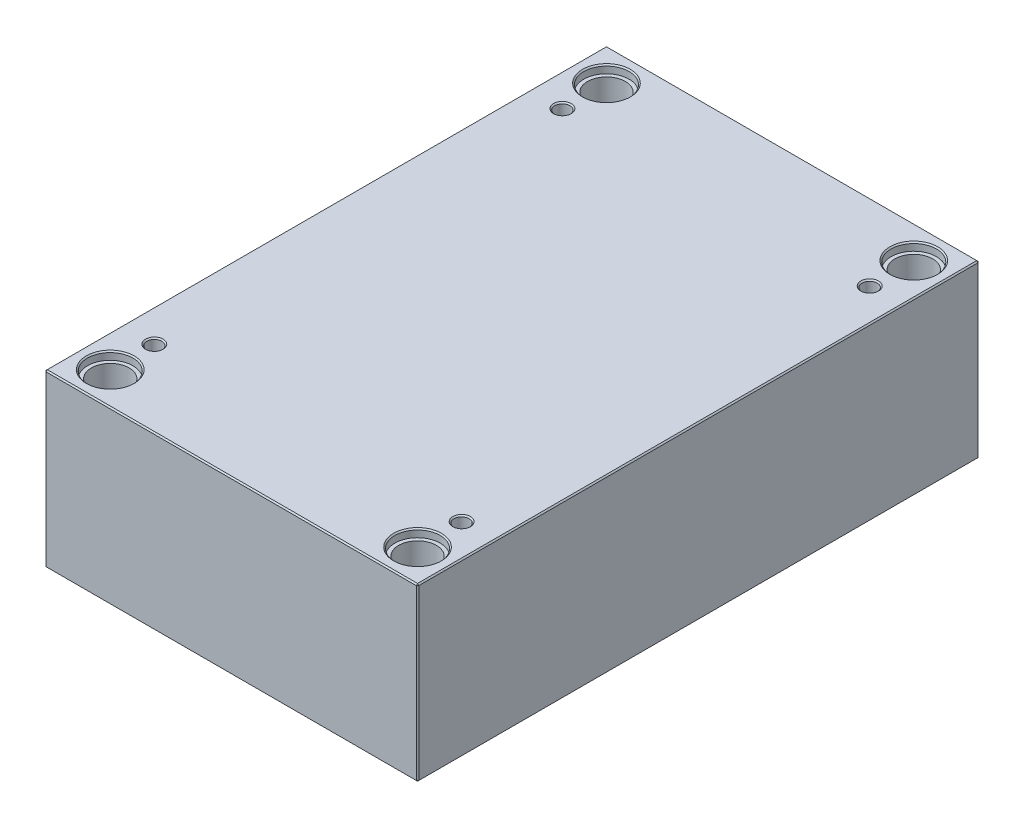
ISO-10303-21;
HEADER;
FILE_DESCRIPTION(('STEP AP214'),'2;1');
FILE_NAME('part.step','',(''),(''),'','','');
FILE_SCHEMA(('AUTOMOTIVE_DESIGN { 1 0 10303 214 1 1 1 1 }'));
ENDSEC;
DATA;
#1=APPLICATION_CONTEXT('core data for automotive mechanical design processes');
#2=APPLICATION_PROTOCOL_DEFINITION('international standard','automotive_design',2000,#1);
#3=PRODUCT_CONTEXT('',#1,'mechanical');
#4=PRODUCT('Part','Part','',(#3));
#5=PRODUCT_RELATED_PRODUCT_CATEGORY('part','',(#4));
#6=PRODUCT_DEFINITION_FORMATION('','',#4);
#7=PRODUCT_DEFINITION_CONTEXT('part definition',#1,'design');
#8=PRODUCT_DEFINITION('design','',#6,#7);
#9=PRODUCT_DEFINITION_SHAPE('','',#8);
#10=(LENGTH_UNIT() NAMED_UNIT(*) SI_UNIT(.MILLI.,.METRE.));
#11=(NAMED_UNIT(*) PLANE_ANGLE_UNIT() SI_UNIT($,.RADIAN.));
#12=(NAMED_UNIT(*) SI_UNIT($,.STERADIAN.) SOLID_ANGLE_UNIT());
#13=UNCERTAINTY_MEASURE_WITH_UNIT(LENGTH_MEASURE(1.E-05),#10,'distance_accuracy_value','');
#14=(GEOMETRIC_REPRESENTATION_CONTEXT(3) GLOBAL_UNCERTAINTY_ASSIGNED_CONTEXT((#13)) GLOBAL_UNIT_ASSIGNED_CONTEXT((#10,
#11,#12)) REPRESENTATION_CONTEXT('',''));
#15=CARTESIAN_POINT('',(0.,0.,0.));
#16=DIRECTION('',(0.,0.,1.));
#17=DIRECTION('',(1.,0.,0.));
#18=AXIS2_PLACEMENT_3D('',#15,#16,#17);
#19=CARTESIAN_POINT('',(-122.,0.,-197.));
#20=DIRECTION('',(0.,1.,0.));
#21=DIRECTION('',(0.,0.,1.));
#22=AXIS2_PLACEMENT_3D('',#19,#20,#21);
#23=CYLINDRICAL_SURFACE('',#22,15.);
#24=CARTESIAN_POINT('',(-122.,1.00000000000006,-197.));
#25=DIRECTION('',(0.,1.,0.));
#26=DIRECTION('',(0.,0.,1.));
#27=AXIS2_PLACEMENT_3D('',#24,#25,#26);
#28=CIRCLE('',#27,15.);
#29=CARTESIAN_POINT('',(-122.,1.00000000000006,-182.));
#30=VERTEX_POINT('',#29);
#31=EDGE_CURVE('E472',#30,#30,#28,.F.);
#32=ORIENTED_EDGE('',*,*,#31,.T.);
#33=EDGE_LOOP('',(#32));
#34=FACE_BOUND('',#33,.T.);
#35=CARTESIAN_POINT('',(-122.,129.7,-197.));
#36=DIRECTION('',(0.,1.,0.));
#37=DIRECTION('',(0.,0.,1.));
#38=AXIS2_PLACEMENT_3D('',#35,#36,#37);
#39=CIRCLE('',#38,15.);
#40=CARTESIAN_POINT('',(-122.,129.7,-182.));
#41=VERTEX_POINT('',#40);
#42=EDGE_CURVE('E221',#41,#41,#39,.F.);
#43=ORIENTED_EDGE('',*,*,#42,.F.);
#44=EDGE_LOOP('',(#43));
#45=FACE_BOUND('',#44,.T.);
#46=ADVANCED_FACE('F16',(#34,#45),#23,.F.);
#47=CARTESIAN_POINT('',(122.,0.,-197.));
#48=DIRECTION('',(0.,1.,0.));
#49=DIRECTION('',(0.,0.,1.));
#50=AXIS2_PLACEMENT_3D('',#47,#48,#49);
#51=CYLINDRICAL_SURFACE('',#50,15.);
#52=CARTESIAN_POINT('',(122.,1.00000000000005,-197.));
#53=DIRECTION('',(0.,1.,0.));
#54=DIRECTION('',(0.,0.,1.));
#55=AXIS2_PLACEMENT_3D('',#52,#53,#54);
#56=CIRCLE('',#55,15.);
#57=CARTESIAN_POINT('',(122.,1.00000000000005,-182.));
#58=VERTEX_POINT('',#57);
#59=EDGE_CURVE('E474',#58,#58,#56,.F.);
#60=ORIENTED_EDGE('',*,*,#59,.T.);
#61=EDGE_LOOP('',(#60));
#62=FACE_BOUND('',#61,.T.);
#63=CARTESIAN_POINT('',(122.,129.7,-197.));
#64=DIRECTION('',(0.,1.,0.));
#65=DIRECTION('',(0.,0.,1.));
#66=AXIS2_PLACEMENT_3D('',#63,#64,#65);
#67=CIRCLE('',#66,15.);
#68=CARTESIAN_POINT('',(122.,129.7,-182.));
#69=VERTEX_POINT('',#68);
#70=EDGE_CURVE('E218',#69,#69,#67,.F.);
#71=ORIENTED_EDGE('',*,*,#70,.F.);
#72=EDGE_LOOP('',(#71));
#73=FACE_BOUND('',#72,.T.);
#74=ADVANCED_FACE('F263',(#62,#73),#51,.F.);
#75=CARTESIAN_POINT('',(122.,0.,197.));
#76=DIRECTION('',(0.,1.,0.));
#77=DIRECTION('',(0.,0.,1.));
#78=AXIS2_PLACEMENT_3D('',#75,#76,#77);
#79=CYLINDRICAL_SURFACE('',#78,15.);
#80=CARTESIAN_POINT('',(122.,1.00000000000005,197.));
#81=DIRECTION('',(0.,1.,0.));
#82=DIRECTION('',(0.,0.,1.));
#83=AXIS2_PLACEMENT_3D('',#80,#81,#82);
#84=CIRCLE('',#83,15.);
#85=CARTESIAN_POINT('',(122.,1.00000000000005,212.));
#86=VERTEX_POINT('',#85);
#87=EDGE_CURVE('E477',#86,#86,#84,.F.);
#88=ORIENTED_EDGE('',*,*,#87,.T.);
#89=EDGE_LOOP('',(#88));
#90=FACE_BOUND('',#89,.T.);
#91=CARTESIAN_POINT('',(122.,129.7,197.));
#92=DIRECTION('',(0.,1.,0.));
#93=DIRECTION('',(0.,0.,1.));
#94=AXIS2_PLACEMENT_3D('',#91,#92,#93);
#95=CIRCLE('',#94,15.);
#96=CARTESIAN_POINT('',(122.,129.7,212.));
#97=VERTEX_POINT('',#96);
#98=EDGE_CURVE('E214',#97,#97,#95,.F.);
#99=ORIENTED_EDGE('',*,*,#98,.F.);
#100=EDGE_LOOP('',(#99));
#101=FACE_BOUND('',#100,.T.);
#102=ADVANCED_FACE('F270',(#90,#101),#79,.F.);
#103=CARTESIAN_POINT('',(-122.,0.,197.));
#104=DIRECTION('',(0.,1.,0.));
#105=DIRECTION('',(0.,0.,1.));
#106=AXIS2_PLACEMENT_3D('',#103,#104,#105);
#107=CYLINDRICAL_SURFACE('',#106,15.);
#108=CARTESIAN_POINT('',(-122.,1.00000000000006,197.));
#109=DIRECTION('',(0.,1.,0.));
#110=DIRECTION('',(0.,0.,1.));
#111=AXIS2_PLACEMENT_3D('',#108,#109,#110);
#112=CIRCLE('',#111,15.);
#113=CARTESIAN_POINT('',(-122.,1.00000000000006,212.));
#114=VERTEX_POINT('',#113);
#115=EDGE_CURVE('E480',#114,#114,#112,.F.);
#116=ORIENTED_EDGE('',*,*,#115,.T.);
#117=EDGE_LOOP('',(#116));
#118=FACE_BOUND('',#117,.T.);
#119=CARTESIAN_POINT('',(-122.,129.7,197.));
#120=DIRECTION('',(0.,1.,0.));
#121=DIRECTION('',(0.,0.,1.));
#122=AXIS2_PLACEMENT_3D('',#119,#120,#121);
#123=CIRCLE('',#122,15.);
#124=CARTESIAN_POINT('',(-122.,129.7,212.));
#125=VERTEX_POINT('',#124);
#126=EDGE_CURVE('E211',#125,#125,#123,.F.);
#127=ORIENTED_EDGE('',*,*,#126,.F.);
#128=EDGE_LOOP('',(#127));
#129=FACE_BOUND('',#128,.T.);
#130=ADVANCED_FACE('F277',(#118,#129),#107,.F.);
#131=CARTESIAN_POINT('',(-148.,136.,223.));
#132=DIRECTION('',(1.,0.,0.));
#133=DIRECTION('',(0.,0.,-1.));
#134=AXIS2_PLACEMENT_3D('',#131,#132,#133);
#135=PLANE('',#134);
#136=DIRECTION('',(0.,-1.,0.));
#137=VECTOR('',#136,1.);
#138=CARTESIAN_POINT('',(-148.,136.,-222.));
#139=LINE('',#138,#137);
#140=CARTESIAN_POINT('',(-148.,135.,-222.));
#141=VERTEX_POINT('',#140);
#142=CARTESIAN_POINT('',(-148.,1.00000000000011,-222.));
#143=VERTEX_POINT('',#142);
#144=EDGE_CURVE('E487',#141,#143,#139,.T.);
#145=ORIENTED_EDGE('',*,*,#144,.T.);
#146=DIRECTION('',(0.,0.,1.));
#147=VECTOR('',#146,1.);
#148=CARTESIAN_POINT('',(-148.,1.00000000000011,223.));
#149=LINE('',#148,#147);
#150=CARTESIAN_POINT('',(-148.,1.00000000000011,222.));
#151=VERTEX_POINT('',#150);
#152=EDGE_CURVE('E490',#143,#151,#149,.T.);
#153=ORIENTED_EDGE('',*,*,#152,.T.);
#154=DIRECTION('',(0.,1.,0.));
#155=VECTOR('',#154,1.);
#156=CARTESIAN_POINT('',(-148.,136.,222.));
#157=LINE('',#156,#155);
#158=CARTESIAN_POINT('',(-148.,135.,222.));
#159=VERTEX_POINT('',#158);
#160=EDGE_CURVE('E485',#151,#159,#157,.T.);
#161=ORIENTED_EDGE('',*,*,#160,.T.);
#162=DIRECTION('',(0.,0.,-1.));
#163=VECTOR('',#162,1.);
#164=CARTESIAN_POINT('',(-148.,135.,-223.));
#165=LINE('',#164,#163);
#166=EDGE_CURVE('E483',#159,#141,#165,.T.);
#167=ORIENTED_EDGE('',*,*,#166,.T.);
#168=EDGE_LOOP('',(#145,#153,#161,#167));
#169=FACE_BOUND('',#168,.T.);
#170=ADVANCED_FACE('F298',(#169),#135,.F.);
#171=CARTESIAN_POINT('',(148.,136.,223.));
#172=DIRECTION('',(0.,0.,-1.));
#173=DIRECTION('',(-1.,0.,0.));
#174=AXIS2_PLACEMENT_3D('',#171,#172,#173);
#175=PLANE('',#174);
#176=DIRECTION('',(-1.,0.,0.));
#177=VECTOR('',#176,1.);
#178=CARTESIAN_POINT('',(-148.,135.,223.));
#179=LINE('',#178,#177);
#180=CARTESIAN_POINT('',(147.,135.,223.));
#181=VERTEX_POINT('',#180);
#182=CARTESIAN_POINT('',(-147.,135.,223.));
#183=VERTEX_POINT('',#182);
#184=EDGE_CURVE('E509',#181,#183,#179,.T.);
#185=ORIENTED_EDGE('',*,*,#184,.T.);
#186=DIRECTION('',(0.,-1.,0.));
#187=VECTOR('',#186,1.);
#188=CARTESIAN_POINT('',(-147.,136.,223.));
#189=LINE('',#188,#187);
#190=CARTESIAN_POINT('',(-147.,1.00000000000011,223.));
#191=VERTEX_POINT('',#190);
#192=EDGE_CURVE('E515',#183,#191,#189,.T.);
#193=ORIENTED_EDGE('',*,*,#192,.T.);
#194=DIRECTION('',(1.,0.,0.));
#195=VECTOR('',#194,1.);
#196=CARTESIAN_POINT('',(148.,1.00000000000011,223.));
#197=LINE('',#196,#195);
#198=CARTESIAN_POINT('',(147.,1.00000000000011,223.));
#199=VERTEX_POINT('',#198);
#200=EDGE_CURVE('E513',#191,#199,#197,.T.);
#201=ORIENTED_EDGE('',*,*,#200,.T.);
#202=DIRECTION('',(0.,1.,0.));
#203=VECTOR('',#202,1.);
#204=CARTESIAN_POINT('',(147.,136.,223.));
#205=LINE('',#204,#203);
#206=EDGE_CURVE('E511',#199,#181,#205,.T.);
#207=ORIENTED_EDGE('',*,*,#206,.T.);
#208=EDGE_LOOP('',(#185,#193,#201,#207));
#209=FACE_BOUND('',#208,.T.);
#210=ADVANCED_FACE('F294',(#209),#175,.F.);
#211=CARTESIAN_POINT('',(148.,136.,223.));
#212=DIRECTION('',(-1.,0.,0.));
#213=DIRECTION('',(0.,0.,1.));
#214=AXIS2_PLACEMENT_3D('',#211,#212,#213);
#215=PLANE('',#214);
#216=DIRECTION('',(0.,0.,-1.));
#217=VECTOR('',#216,1.);
#218=CARTESIAN_POINT('',(148.,1.00000000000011,223.));
#219=LINE('',#218,#217);
#220=CARTESIAN_POINT('',(148.,1.00000000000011,222.));
#221=VERTEX_POINT('',#220);
#222=CARTESIAN_POINT('',(148.,1.00000000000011,-222.));
#223=VERTEX_POINT('',#222);
#224=EDGE_CURVE('E504',#221,#223,#219,.T.);
#225=ORIENTED_EDGE('',*,*,#224,.T.);
#226=DIRECTION('',(0.,1.,0.));
#227=VECTOR('',#226,1.);
#228=CARTESIAN_POINT('',(148.,136.,-222.));
#229=LINE('',#228,#227);
#230=CARTESIAN_POINT('',(148.,135.,-222.));
#231=VERTEX_POINT('',#230);
#232=EDGE_CURVE('E506',#223,#231,#229,.T.);
#233=ORIENTED_EDGE('',*,*,#232,.T.);
#234=DIRECTION('',(0.,0.,1.));
#235=VECTOR('',#234,1.);
#236=CARTESIAN_POINT('',(148.,135.,223.));
#237=LINE('',#236,#235);
#238=CARTESIAN_POINT('',(148.,135.,222.));
#239=VERTEX_POINT('',#238);
#240=EDGE_CURVE('E500',#231,#239,#237,.T.);
#241=ORIENTED_EDGE('',*,*,#240,.T.);
#242=DIRECTION('',(0.,-1.,0.));
#243=VECTOR('',#242,1.);
#244=CARTESIAN_POINT('',(148.,136.,222.));
#245=LINE('',#244,#243);
#246=EDGE_CURVE('E502',#239,#221,#245,.T.);
#247=ORIENTED_EDGE('',*,*,#246,.T.);
#248=EDGE_LOOP('',(#225,#233,#241,#247));
#249=FACE_BOUND('',#248,.T.);
#250=ADVANCED_FACE('F290',(#249),#215,.F.);
#251=CARTESIAN_POINT('',(148.,136.,-223.));
#252=DIRECTION('',(0.,0.,1.));
#253=DIRECTION('',(1.,0.,0.));
#254=AXIS2_PLACEMENT_3D('',#251,#252,#253);
#255=PLANE('',#254);
#256=DIRECTION('',(0.,-1.,0.));
#257=VECTOR('',#256,1.);
#258=CARTESIAN_POINT('',(147.,136.,-223.));
#259=LINE('',#258,#257);
#260=CARTESIAN_POINT('',(147.,135.,-223.));
#261=VERTEX_POINT('',#260);
#262=CARTESIAN_POINT('',(147.,1.00000000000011,-223.));
#263=VERTEX_POINT('',#262);
#264=EDGE_CURVE('E494',#261,#263,#259,.T.);
#265=ORIENTED_EDGE('',*,*,#264,.T.);
#266=DIRECTION('',(-1.,0.,0.));
#267=VECTOR('',#266,1.);
#268=CARTESIAN_POINT('',(148.,1.00000000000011,-223.));
#269=LINE('',#268,#267);
#270=CARTESIAN_POINT('',(-147.,1.00000000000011,-223.));
#271=VERTEX_POINT('',#270);
#272=EDGE_CURVE('E138',#263,#271,#269,.T.);
#273=ORIENTED_EDGE('',*,*,#272,.T.);
#274=DIRECTION('',(0.,1.,0.));
#275=VECTOR('',#274,1.);
#276=CARTESIAN_POINT('',(-147.,136.,-223.));
#277=LINE('',#276,#275);
#278=CARTESIAN_POINT('',(-147.,135.,-223.));
#279=VERTEX_POINT('',#278);
#280=EDGE_CURVE('E496',#271,#279,#277,.T.);
#281=ORIENTED_EDGE('',*,*,#280,.T.);
#282=DIRECTION('',(1.,0.,0.));
#283=VECTOR('',#282,1.);
#284=CARTESIAN_POINT('',(148.,135.,-223.));
#285=LINE('',#284,#283);
#286=EDGE_CURVE('E492',#279,#261,#285,.T.);
#287=ORIENTED_EDGE('',*,*,#286,.T.);
#288=EDGE_LOOP('',(#265,#273,#281,#287));
#289=FACE_BOUND('',#288,.T.);
#290=ADVANCED_FACE('F282',(#289),#255,.F.);
#291=CARTESIAN_POINT('',(0.,136.,0.));
#292=DIRECTION('',(0.,1.,0.));
#293=DIRECTION('',(0.,0.,1.));
#294=AXIS2_PLACEMENT_3D('',#291,#292,#293);
#295=PLANE('',#294);
#296=CARTESIAN_POINT('',(122.,136.,197.));
#297=DIRECTION('',(0.,1.,0.));
#298=DIRECTION('',(0.,0.,1.));
#299=AXIS2_PLACEMENT_3D('',#296,#297,#298);
#300=CIRCLE('',#299,19.);
#301=CARTESIAN_POINT('',(122.,136.,216.));
#302=VERTEX_POINT('',#301);
#303=EDGE_CURVE('E236',#302,#302,#300,.F.);
#304=ORIENTED_EDGE('',*,*,#303,.T.);
#305=EDGE_LOOP('',(#304));
#306=FACE_BOUND('',#305,.T.);
#307=CARTESIAN_POINT('',(-122.,136.,197.));
#308=DIRECTION('',(0.,1.,0.));
#309=DIRECTION('',(0.,0.,1.));
#310=AXIS2_PLACEMENT_3D('',#307,#308,#309);
#311=CIRCLE('',#310,19.);
#312=CARTESIAN_POINT('',(-122.,136.,216.));
#313=VERTEX_POINT('',#312);
#314=EDGE_CURVE('E233',#313,#313,#311,.F.);
#315=ORIENTED_EDGE('',*,*,#314,.T.);
#316=EDGE_LOOP('',(#315));
#317=FACE_BOUND('',#316,.T.);
#318=CARTESIAN_POINT('',(122.,136.,-197.));
#319=DIRECTION('',(0.,1.,0.));
#320=DIRECTION('',(0.,0.,1.));
#321=AXIS2_PLACEMENT_3D('',#318,#319,#320);
#322=CIRCLE('',#321,19.);
#323=CARTESIAN_POINT('',(122.,136.,-178.));
#324=VERTEX_POINT('',#323);
#325=EDGE_CURVE('E230',#324,#324,#322,.F.);
#326=ORIENTED_EDGE('',*,*,#325,.T.);
#327=EDGE_LOOP('',(#326));
#328=FACE_BOUND('',#327,.T.);
#329=CARTESIAN_POINT('',(-122.,136.,-197.));
#330=DIRECTION('',(0.,1.,0.));
#331=DIRECTION('',(0.,0.,1.));
#332=AXIS2_PLACEMENT_3D('',#329,#330,#331);
#333=CIRCLE('',#332,19.);
#334=CARTESIAN_POINT('',(-122.,136.,-178.));
#335=VERTEX_POINT('',#334);
#336=EDGE_CURVE('E227',#335,#335,#333,.F.);
#337=ORIENTED_EDGE('',*,*,#336,.T.);
#338=EDGE_LOOP('',(#337));
#339=FACE_BOUND('',#338,.T.);
#340=CARTESIAN_POINT('',(-122.,136.,162.));
#341=DIRECTION('',(0.,1.,0.));
#342=DIRECTION('',(0.,0.,1.));
#343=AXIS2_PLACEMENT_3D('',#340,#341,#342);
#344=CIRCLE('',#343,7.);
#345=CARTESIAN_POINT('',(-122.,136.,169.));
#346=VERTEX_POINT('',#345);
#347=EDGE_CURVE('E198',#346,#346,#344,.F.);
#348=ORIENTED_EDGE('',*,*,#347,.T.);
#349=EDGE_LOOP('',(#348));
#350=FACE_BOUND('',#349,.T.);
#351=CARTESIAN_POINT('',(122.,136.,162.));
#352=DIRECTION('',(0.,1.,0.));
#353=DIRECTION('',(0.,0.,1.));
#354=AXIS2_PLACEMENT_3D('',#351,#352,#353);
#355=CIRCLE('',#354,7.);
#356=CARTESIAN_POINT('',(122.,136.,169.));
#357=VERTEX_POINT('',#356);
#358=EDGE_CURVE('E195',#357,#357,#355,.F.);
#359=ORIENTED_EDGE('',*,*,#358,.T.);
#360=EDGE_LOOP('',(#359));
#361=FACE_BOUND('',#360,.T.);
#362=CARTESIAN_POINT('',(122.,136.,-162.));
#363=DIRECTION('',(0.,1.,0.));
#364=DIRECTION('',(0.,0.,1.));
#365=AXIS2_PLACEMENT_3D('',#362,#363,#364);
#366=CIRCLE('',#365,7.);
#367=CARTESIAN_POINT('',(122.,136.,-155.));
#368=VERTEX_POINT('',#367);
#369=EDGE_CURVE('E192',#368,#368,#366,.F.);
#370=ORIENTED_EDGE('',*,*,#369,.T.);
#371=EDGE_LOOP('',(#370));
#372=FACE_BOUND('',#371,.T.);
#373=CARTESIAN_POINT('',(-122.,136.,-162.));
#374=DIRECTION('',(0.,1.,0.));
#375=DIRECTION('',(0.,0.,1.));
#376=AXIS2_PLACEMENT_3D('',#373,#374,#375);
#377=CIRCLE('',#376,7.);
#378=CARTESIAN_POINT('',(-122.,136.,-155.));
#379=VERTEX_POINT('',#378);
#380=EDGE_CURVE('E188',#379,#379,#377,.F.);
#381=ORIENTED_EDGE('',*,*,#380,.T.);
#382=EDGE_LOOP('',(#381));
#383=FACE_BOUND('',#382,.T.);
#384=DIRECTION('',(0.,0.,-1.));
#385=VECTOR('',#384,1.);
#386=CARTESIAN_POINT('',(147.,136.,-223.));
#387=LINE('',#386,#385);
#388=CARTESIAN_POINT('',(147.,136.,222.));
#389=VERTEX_POINT('',#388);
#390=CARTESIAN_POINT('',(147.,136.,-222.));
#391=VERTEX_POINT('',#390);
#392=EDGE_CURVE('E31',#389,#391,#387,.T.);
#393=ORIENTED_EDGE('',*,*,#392,.T.);
#394=DIRECTION('',(-1.,0.,0.));
#395=VECTOR('',#394,1.);
#396=CARTESIAN_POINT('',(-148.,136.,-222.));
#397=LINE('',#396,#395);
#398=CARTESIAN_POINT('',(-147.,136.,-222.));
#399=VERTEX_POINT('',#398);
#400=EDGE_CURVE('E189',#391,#399,#397,.T.);
#401=ORIENTED_EDGE('',*,*,#400,.T.);
#402=DIRECTION('',(0.,0.,1.));
#403=VECTOR('',#402,1.);
#404=CARTESIAN_POINT('',(-147.,136.,223.));
#405=LINE('',#404,#403);
#406=CARTESIAN_POINT('',(-147.,136.,222.));
#407=VERTEX_POINT('',#406);
#408=EDGE_CURVE('E518',#399,#407,#405,.T.);
#409=ORIENTED_EDGE('',*,*,#408,.T.);
#410=DIRECTION('',(1.,0.,0.));
#411=VECTOR('',#410,1.);
#412=CARTESIAN_POINT('',(148.,136.,222.));
#413=LINE('',#412,#411);
#414=EDGE_CURVE('E36',#407,#389,#413,.T.);
#415=ORIENTED_EDGE('',*,*,#414,.T.);
#416=EDGE_LOOP('',(#393,#401,#409,#415));
#417=FACE_BOUND('',#416,.T.);
#418=ADVANCED_FACE('F279',(#306,#317,#328,#339,#350,#361,#372,#383,#417),#295,.T.);
#419=CARTESIAN_POINT('',(0.,0.,0.));
#420=DIRECTION('',(0.,1.,0.));
#421=DIRECTION('',(0.,0.,1.));
#422=AXIS2_PLACEMENT_3D('',#419,#420,#421);
#423=PLANE('',#422);
#424=CARTESIAN_POINT('',(-122.,0.,-197.));
#425=DIRECTION('',(0.,1.,0.));
#426=DIRECTION('',(0.,0.,1.));
#427=AXIS2_PLACEMENT_3D('',#424,#425,#426);
#428=CIRCLE('',#427,16.);
#429=CARTESIAN_POINT('',(-122.,0.,-181.));
#430=VERTEX_POINT('',#429);
#431=EDGE_CURVE('E469',#430,#430,#428,.T.);
#432=ORIENTED_EDGE('',*,*,#431,.T.);
#433=EDGE_LOOP('',(#432));
#434=FACE_BOUND('',#433,.T.);
#435=CARTESIAN_POINT('',(122.,0.,-197.));
#436=DIRECTION('',(0.,1.,0.));
#437=DIRECTION('',(0.,0.,1.));
#438=AXIS2_PLACEMENT_3D('',#435,#436,#437);
#439=CIRCLE('',#438,16.);
#440=CARTESIAN_POINT('',(122.,0.,-181.));
#441=VERTEX_POINT('',#440);
#442=EDGE_CURVE('E466',#441,#441,#439,.T.);
#443=ORIENTED_EDGE('',*,*,#442,.T.);
#444=EDGE_LOOP('',(#443));
#445=FACE_BOUND('',#444,.T.);
#446=CARTESIAN_POINT('',(122.,0.,197.));
#447=DIRECTION('',(0.,1.,0.));
#448=DIRECTION('',(0.,0.,1.));
#449=AXIS2_PLACEMENT_3D('',#446,#447,#448);
#450=CIRCLE('',#449,16.);
#451=CARTESIAN_POINT('',(122.,0.,213.));
#452=VERTEX_POINT('',#451);
#453=EDGE_CURVE('E463',#452,#452,#450,.T.);
#454=ORIENTED_EDGE('',*,*,#453,.T.);
#455=EDGE_LOOP('',(#454));
#456=FACE_BOUND('',#455,.T.);
#457=CARTESIAN_POINT('',(-122.,0.,197.));
#458=DIRECTION('',(0.,1.,0.));
#459=DIRECTION('',(0.,0.,1.));
#460=AXIS2_PLACEMENT_3D('',#457,#458,#459);
#461=CIRCLE('',#460,16.);
#462=CARTESIAN_POINT('',(-122.,0.,213.));
#463=VERTEX_POINT('',#462);
#464=EDGE_CURVE('E460',#463,#463,#461,.T.);
#465=ORIENTED_EDGE('',*,*,#464,.T.);
#466=EDGE_LOOP('',(#465));
#467=FACE_BOUND('',#466,.T.);
#468=DIRECTION('',(0.,0.,1.));
#469=VECTOR('',#468,1.);
#470=CARTESIAN_POINT('',(147.,0.,0.));
#471=LINE('',#470,#469);
#472=CARTESIAN_POINT('',(147.,0.,-222.));
#473=VERTEX_POINT('',#472);
#474=CARTESIAN_POINT('',(147.,0.,222.));
#475=VERTEX_POINT('',#474);
#476=EDGE_CURVE('E108',#473,#475,#471,.T.);
#477=ORIENTED_EDGE('',*,*,#476,.T.);
#478=DIRECTION('',(-1.,0.,0.));
#479=VECTOR('',#478,1.);
#480=CARTESIAN_POINT('',(0.,0.,222.));
#481=LINE('',#480,#479);
#482=CARTESIAN_POINT('',(-147.,0.,222.));
#483=VERTEX_POINT('',#482);
#484=EDGE_CURVE('E458',#475,#483,#481,.T.);
#485=ORIENTED_EDGE('',*,*,#484,.T.);
#486=DIRECTION('',(0.,0.,-1.));
#487=VECTOR('',#486,1.);
#488=CARTESIAN_POINT('',(-147.,0.,0.));
#489=LINE('',#488,#487);
#490=CARTESIAN_POINT('',(-147.,0.,-222.));
#491=VERTEX_POINT('',#490);
#492=EDGE_CURVE('E110',#483,#491,#489,.T.);
#493=ORIENTED_EDGE('',*,*,#492,.T.);
#494=DIRECTION('',(1.,0.,0.));
#495=VECTOR('',#494,1.);
#496=CARTESIAN_POINT('',(0.,0.,-222.));
#497=LINE('',#496,#495);
#498=EDGE_CURVE('E104',#491,#473,#497,.T.);
#499=ORIENTED_EDGE('',*,*,#498,.T.);
#500=EDGE_LOOP('',(#477,#485,#493,#499));
#501=FACE_BOUND('',#500,.T.);
#502=ADVANCED_FACE('F106',(#434,#445,#456,#467,#501),#423,.F.);
#503=CARTESIAN_POINT('',(-122.,0.,-197.));
#504=DIRECTION('',(0.,-1.,0.));
#505=DIRECTION('',(0.,0.,-1.));
#506=AXIS2_PLACEMENT_3D('',#503,#504,#505);
#507=CONICAL_SURFACE('',#506,16.,0.785398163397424);
#508=ORIENTED_EDGE('',*,*,#31,.F.);
#509=EDGE_LOOP('',(#508));
#510=FACE_BOUND('',#509,.T.);
#511=ORIENTED_EDGE('',*,*,#431,.F.);
#512=EDGE_LOOP('',(#511));
#513=FACE_BOUND('',#512,.T.);
#514=ADVANCED_FACE('F286',(#510,#513),#507,.F.);
#515=CARTESIAN_POINT('',(122.,0.,-197.));
#516=DIRECTION('',(0.,-1.,0.));
#517=DIRECTION('',(0.,0.,-1.));
#518=AXIS2_PLACEMENT_3D('',#515,#516,#517);
#519=CONICAL_SURFACE('',#518,16.,0.78539816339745);
#520=ORIENTED_EDGE('',*,*,#59,.F.);
#521=EDGE_LOOP('',(#520));
#522=FACE_BOUND('',#521,.T.);
#523=ORIENTED_EDGE('',*,*,#442,.F.);
#524=EDGE_LOOP('',(#523));
#525=FACE_BOUND('',#524,.T.);
#526=ADVANCED_FACE('F305',(#522,#525),#519,.F.);
#527=CARTESIAN_POINT('',(122.,0.,197.));
#528=DIRECTION('',(0.,-1.,0.));
#529=DIRECTION('',(0.,0.,-1.));
#530=AXIS2_PLACEMENT_3D('',#527,#528,#529);
#531=CONICAL_SURFACE('',#530,16.,0.78539816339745);
#532=ORIENTED_EDGE('',*,*,#87,.F.);
#533=EDGE_LOOP('',(#532));
#534=FACE_BOUND('',#533,.T.);
#535=ORIENTED_EDGE('',*,*,#453,.F.);
#536=EDGE_LOOP('',(#535));
#537=FACE_BOUND('',#536,.T.);
#538=ADVANCED_FACE('F309',(#534,#537),#531,.F.);
#539=CARTESIAN_POINT('',(-122.,0.,197.));
#540=DIRECTION('',(0.,-1.,0.));
#541=DIRECTION('',(0.,0.,-1.));
#542=AXIS2_PLACEMENT_3D('',#539,#540,#541);
#543=CONICAL_SURFACE('',#542,16.,0.785398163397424);
#544=ORIENTED_EDGE('',*,*,#115,.F.);
#545=EDGE_LOOP('',(#544));
#546=FACE_BOUND('',#545,.T.);
#547=ORIENTED_EDGE('',*,*,#464,.F.);
#548=EDGE_LOOP('',(#547));
#549=FACE_BOUND('',#548,.T.);
#550=ADVANCED_FACE('F313',(#546,#549),#543,.F.);
#551=CARTESIAN_POINT('',(148.,136.,222.));
#552=DIRECTION('',(-0.707106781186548,0.,-0.707106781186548));
#553=DIRECTION('',(0.,-1.,0.));
#554=AXIS2_PLACEMENT_3D('',#551,#552,#553);
#555=PLANE('',#554);
#556=DIRECTION('',(-0.707106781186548,0.,0.707106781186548));
#557=VECTOR('',#556,1.);
#558=CARTESIAN_POINT('',(147.,135.,223.));
#559=LINE('',#558,#557);
#560=EDGE_CURVE('E126',#181,#239,#559,.F.);
#561=ORIENTED_EDGE('',*,*,#560,.F.);
#562=ORIENTED_EDGE('',*,*,#206,.F.);
#563=DIRECTION('',(0.707106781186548,0.,-0.707106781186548));
#564=VECTOR('',#563,1.);
#565=CARTESIAN_POINT('',(147.,1.00000000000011,223.));
#566=LINE('',#565,#564);
#567=EDGE_CURVE('E180',#221,#199,#566,.F.);
#568=ORIENTED_EDGE('',*,*,#567,.F.);
#569=ORIENTED_EDGE('',*,*,#246,.F.);
#570=EDGE_LOOP('',(#561,#562,#568,#569));
#571=FACE_BOUND('',#570,.T.);
#572=ADVANCED_FACE('F317',(#571),#555,.F.);
#573=CARTESIAN_POINT('',(147.,135.,223.));
#574=DIRECTION('',(0.577350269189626,0.577350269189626,0.577350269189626));
#575=DIRECTION('',(0.707106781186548,0.,-0.707106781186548));
#576=AXIS2_PLACEMENT_3D('',#573,#574,#575);
#577=PLANE('',#576);
#578=DIRECTION('',(0.,-0.707106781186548,0.707106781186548));
#579=VECTOR('',#578,1.);
#580=CARTESIAN_POINT('',(147.,135.,223.));
#581=LINE('',#580,#579);
#582=EDGE_CURVE('E175',#181,#389,#581,.F.);
#583=ORIENTED_EDGE('',*,*,#582,.F.);
#584=ORIENTED_EDGE('',*,*,#560,.T.);
#585=DIRECTION('',(-0.707106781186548,0.707106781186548,0.));
#586=VECTOR('',#585,1.);
#587=CARTESIAN_POINT('',(147.5,135.5,222.));
#588=LINE('',#587,#586);
#589=EDGE_CURVE('E177',#389,#239,#588,.F.);
#590=ORIENTED_EDGE('',*,*,#589,.F.);
#591=EDGE_LOOP('',(#583,#584,#590));
#592=FACE_BOUND('',#591,.T.);
#593=ADVANCED_FACE('F385',(#592),#577,.T.);
#594=CARTESIAN_POINT('',(147.,1.00000000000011,223.));
#595=DIRECTION('',(0.577350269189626,-0.577350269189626,0.577350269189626));
#596=DIRECTION('',(0.707106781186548,0.,-0.707106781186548));
#597=AXIS2_PLACEMENT_3D('',#594,#595,#596);
#598=PLANE('',#597);
#599=DIRECTION('',(-0.707106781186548,-0.707106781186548,0.));
#600=VECTOR('',#599,1.);
#601=CARTESIAN_POINT('',(147.5,0.500000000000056,222.));
#602=LINE('',#601,#600);
#603=EDGE_CURVE('E124',#221,#475,#602,.T.);
#604=ORIENTED_EDGE('',*,*,#603,.F.);
#605=ORIENTED_EDGE('',*,*,#567,.T.);
#606=DIRECTION('',(0.,0.707106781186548,0.707106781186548));
#607=VECTOR('',#606,1.);
#608=CARTESIAN_POINT('',(147.,1.00000000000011,223.));
#609=LINE('',#608,#607);
#610=EDGE_CURVE('E172',#475,#199,#609,.T.);
#611=ORIENTED_EDGE('',*,*,#610,.F.);
#612=EDGE_LOOP('',(#604,#605,#611));
#613=FACE_BOUND('',#612,.T.);
#614=ADVANCED_FACE('F381',(#613),#598,.T.);
#615=CARTESIAN_POINT('',(147.,136.,0.));
#616=DIRECTION('',(0.707106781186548,0.707106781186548,0.));
#617=DIRECTION('',(0.,0.,1.));
#618=AXIS2_PLACEMENT_3D('',#615,#616,#617);
#619=PLANE('',#618);
#620=ORIENTED_EDGE('',*,*,#589,.T.);
#621=ORIENTED_EDGE('',*,*,#240,.F.);
#622=DIRECTION('',(0.707106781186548,-0.707106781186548,0.));
#623=VECTOR('',#622,1.);
#624=CARTESIAN_POINT('',(148.,135.,-222.));
#625=LINE('',#624,#623);
#626=EDGE_CURVE('E166',#391,#231,#625,.T.);
#627=ORIENTED_EDGE('',*,*,#626,.F.);
#628=ORIENTED_EDGE('',*,*,#392,.F.);
#629=EDGE_LOOP('',(#620,#621,#627,#628));
#630=FACE_BOUND('',#629,.T.);
#631=ADVANCED_FACE('F377',(#630),#619,.T.);
#632=CARTESIAN_POINT('',(0.,136.,222.));
#633=DIRECTION('',(0.,0.707106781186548,0.707106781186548));
#634=DIRECTION('',(-1.,0.,0.));
#635=AXIS2_PLACEMENT_3D('',#632,#633,#634);
#636=PLANE('',#635);
#637=ORIENTED_EDGE('',*,*,#582,.T.);
#638=ORIENTED_EDGE('',*,*,#414,.F.);
#639=DIRECTION('',(0.,0.707106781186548,-0.707106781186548));
#640=VECTOR('',#639,1.);
#641=CARTESIAN_POINT('',(-147.,135.5,222.5));
#642=LINE('',#641,#640);
#643=EDGE_CURVE('E163',#183,#407,#642,.T.);
#644=ORIENTED_EDGE('',*,*,#643,.F.);
#645=ORIENTED_EDGE('',*,*,#184,.F.);
#646=EDGE_LOOP('',(#637,#638,#644,#645));
#647=FACE_BOUND('',#646,.T.);
#648=ADVANCED_FACE('F373',(#647),#636,.T.);
#649=CARTESIAN_POINT('',(-147.,136.,223.));
#650=DIRECTION('',(0.707106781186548,0.,-0.707106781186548));
#651=DIRECTION('',(0.,-1.,0.));
#652=AXIS2_PLACEMENT_3D('',#649,#650,#651);
#653=PLANE('',#652);
#654=DIRECTION('',(0.707106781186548,0.,0.707106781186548));
#655=VECTOR('',#654,1.);
#656=CARTESIAN_POINT('',(-147.,1.00000000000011,223.));
#657=LINE('',#656,#655);
#658=EDGE_CURVE('E157',#191,#151,#657,.F.);
#659=ORIENTED_EDGE('',*,*,#658,.F.);
#660=ORIENTED_EDGE('',*,*,#192,.F.);
#661=DIRECTION('',(-0.707106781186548,0.,-0.707106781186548));
#662=VECTOR('',#661,1.);
#663=CARTESIAN_POINT('',(-148.,135.,222.));
#664=LINE('',#663,#662);
#665=EDGE_CURVE('E160',#159,#183,#664,.F.);
#666=ORIENTED_EDGE('',*,*,#665,.F.);
#667=ORIENTED_EDGE('',*,*,#160,.F.);
#668=EDGE_LOOP('',(#659,#660,#666,#667));
#669=FACE_BOUND('',#668,.T.);
#670=ADVANCED_FACE('F369',(#669),#653,.F.);
#671=CARTESIAN_POINT('',(148.,1.00000000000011,223.));
#672=DIRECTION('',(0.,0.707106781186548,-0.707106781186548));
#673=DIRECTION('',(1.,0.,0.));
#674=AXIS2_PLACEMENT_3D('',#671,#672,#673);
#675=PLANE('',#674);
#676=ORIENTED_EDGE('',*,*,#610,.T.);
#677=ORIENTED_EDGE('',*,*,#200,.F.);
#678=DIRECTION('',(0.,-0.707106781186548,-0.707106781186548));
#679=VECTOR('',#678,1.);
#680=CARTESIAN_POINT('',(-147.,1.00000000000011,223.));
#681=LINE('',#680,#679);
#682=EDGE_CURVE('E135',#483,#191,#681,.F.);
#683=ORIENTED_EDGE('',*,*,#682,.F.);
#684=ORIENTED_EDGE('',*,*,#484,.F.);
#685=EDGE_LOOP('',(#676,#677,#683,#684));
#686=FACE_BOUND('',#685,.T.);
#687=ADVANCED_FACE('F366',(#686),#675,.F.);
#688=CARTESIAN_POINT('',(148.,1.00000000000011,223.));
#689=DIRECTION('',(-0.707106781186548,0.707106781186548,0.));
#690=DIRECTION('',(0.,0.,-1.));
#691=AXIS2_PLACEMENT_3D('',#688,#689,#690);
#692=PLANE('',#691);
#693=ORIENTED_EDGE('',*,*,#603,.T.);
#694=ORIENTED_EDGE('',*,*,#476,.F.);
#695=DIRECTION('',(0.707106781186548,0.707106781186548,0.));
#696=VECTOR('',#695,1.);
#697=CARTESIAN_POINT('',(147.5,0.500000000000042,-222.));
#698=LINE('',#697,#696);
#699=EDGE_CURVE('E121',#223,#473,#698,.F.);
#700=ORIENTED_EDGE('',*,*,#699,.F.);
#701=ORIENTED_EDGE('',*,*,#224,.F.);
#702=EDGE_LOOP('',(#693,#694,#700,#701));
#703=FACE_BOUND('',#702,.T.);
#704=ADVANCED_FACE('F119',(#703),#692,.F.);
#705=CARTESIAN_POINT('',(147.,136.,-223.));
#706=DIRECTION('',(-0.707106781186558,0.,0.707106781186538));
#707=DIRECTION('',(0.,-1.,0.));
#708=AXIS2_PLACEMENT_3D('',#705,#706,#707);
#709=PLANE('',#708);
#710=DIRECTION('',(0.707106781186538,0.,0.707106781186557));
#711=VECTOR('',#710,1.);
#712=CARTESIAN_POINT('',(148.,135.,-222.));
#713=LINE('',#712,#711);
#714=EDGE_CURVE('E168',#231,#261,#713,.F.);
#715=ORIENTED_EDGE('',*,*,#714,.F.);
#716=ORIENTED_EDGE('',*,*,#232,.F.);
#717=DIRECTION('',(-0.707106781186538,0.,-0.707106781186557));
#718=VECTOR('',#717,1.);
#719=CARTESIAN_POINT('',(147.,1.00000000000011,-223.));
#720=LINE('',#719,#718);
#721=EDGE_CURVE('E134',#263,#223,#720,.F.);
#722=ORIENTED_EDGE('',*,*,#721,.F.);
#723=ORIENTED_EDGE('',*,*,#264,.F.);
#724=EDGE_LOOP('',(#715,#716,#722,#723));
#725=FACE_BOUND('',#724,.T.);
#726=ADVANCED_FACE('F359',(#725),#709,.F.);
#727=CARTESIAN_POINT('',(148.,135.,-222.));
#728=DIRECTION('',(0.577350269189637,0.577350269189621,-0.577350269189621));
#729=DIRECTION('',(-0.707106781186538,0.,-0.707106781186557));
#730=AXIS2_PLACEMENT_3D('',#727,#728,#729);
#731=PLANE('',#730);
#732=ORIENTED_EDGE('',*,*,#626,.T.);
#733=ORIENTED_EDGE('',*,*,#714,.T.);
#734=DIRECTION('',(0.,0.707106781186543,0.707106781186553));
#735=VECTOR('',#734,1.);
#736=CARTESIAN_POINT('',(147.,135.5,-222.5));
#737=LINE('',#736,#735);
#738=EDGE_CURVE('E152',#391,#261,#737,.F.);
#739=ORIENTED_EDGE('',*,*,#738,.F.);
#740=EDGE_LOOP('',(#732,#733,#739));
#741=FACE_BOUND('',#740,.T.);
#742=ADVANCED_FACE('F355',(#741),#731,.T.);
#743=CARTESIAN_POINT('',(-148.,135.,222.));
#744=DIRECTION('',(-0.577350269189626,0.577350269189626,0.577350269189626));
#745=DIRECTION('',(0.707106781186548,0.,0.707106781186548));
#746=AXIS2_PLACEMENT_3D('',#743,#744,#745);
#747=PLANE('',#746);
#748=ORIENTED_EDGE('',*,*,#665,.T.);
#749=ORIENTED_EDGE('',*,*,#643,.T.);
#750=DIRECTION('',(-0.707106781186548,-0.707106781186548,0.));
#751=VECTOR('',#750,1.);
#752=CARTESIAN_POINT('',(-148.,135.,222.));
#753=LINE('',#752,#751);
#754=EDGE_CURVE('E143',#159,#407,#753,.F.);
#755=ORIENTED_EDGE('',*,*,#754,.F.);
#756=EDGE_LOOP('',(#748,#749,#755));
#757=FACE_BOUND('',#756,.T.);
#758=ADVANCED_FACE('F351',(#757),#747,.T.);
#759=CARTESIAN_POINT('',(-147.,1.00000000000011,223.));
#760=DIRECTION('',(-0.577350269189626,-0.577350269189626,0.577350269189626));
#761=DIRECTION('',(0.707106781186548,0.,0.707106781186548));
#762=AXIS2_PLACEMENT_3D('',#759,#760,#761);
#763=PLANE('',#762);
#764=ORIENTED_EDGE('',*,*,#682,.T.);
#765=ORIENTED_EDGE('',*,*,#658,.T.);
#766=DIRECTION('',(-0.707106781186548,0.707106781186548,0.));
#767=VECTOR('',#766,1.);
#768=CARTESIAN_POINT('',(-147.5,0.500000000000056,222.));
#769=LINE('',#768,#767);
#770=EDGE_CURVE('E139',#483,#151,#769,.T.);
#771=ORIENTED_EDGE('',*,*,#770,.F.);
#772=EDGE_LOOP('',(#764,#765,#771));
#773=FACE_BOUND('',#772,.T.);
#774=ADVANCED_FACE('F348',(#773),#763,.T.);
#775=CARTESIAN_POINT('',(147.,1.00000000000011,-223.));
#776=DIRECTION('',(0.577350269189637,-0.577350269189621,-0.577350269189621));
#777=DIRECTION('',(-0.707106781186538,0.,-0.707106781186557));
#778=AXIS2_PLACEMENT_3D('',#775,#776,#777);
#779=PLANE('',#778);
#780=ORIENTED_EDGE('',*,*,#721,.T.);
#781=ORIENTED_EDGE('',*,*,#699,.T.);
#782=DIRECTION('',(0.,-0.707106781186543,0.707106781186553));
#783=VECTOR('',#782,1.);
#784=CARTESIAN_POINT('',(147.,1.00000000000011,-223.));
#785=LINE('',#784,#783);
#786=EDGE_CURVE('E131',#263,#473,#785,.T.);
#787=ORIENTED_EDGE('',*,*,#786,.F.);
#788=EDGE_LOOP('',(#780,#781,#787));
#789=FACE_BOUND('',#788,.T.);
#790=ADVANCED_FACE('F130',(#789),#779,.T.);
#791=CARTESIAN_POINT('',(0.,136.,-222.));
#792=DIRECTION('',(0.,0.707106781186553,-0.707106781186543));
#793=DIRECTION('',(1.,0.,0.));
#794=AXIS2_PLACEMENT_3D('',#791,#792,#793);
#795=PLANE('',#794);
#796=ORIENTED_EDGE('',*,*,#738,.T.);
#797=ORIENTED_EDGE('',*,*,#286,.F.);
#798=DIRECTION('',(0.,-0.707106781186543,-0.707106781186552));
#799=VECTOR('',#798,1.);
#800=CARTESIAN_POINT('',(-147.,135.,-223.));
#801=LINE('',#800,#799);
#802=EDGE_CURVE('E140',#399,#279,#801,.T.);
#803=ORIENTED_EDGE('',*,*,#802,.F.);
#804=ORIENTED_EDGE('',*,*,#400,.F.);
#805=EDGE_LOOP('',(#796,#797,#803,#804));
#806=FACE_BOUND('',#805,.T.);
#807=ADVANCED_FACE('F341',(#806),#795,.T.);
#808=CARTESIAN_POINT('',(-147.,136.,0.));
#809=DIRECTION('',(-0.707106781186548,0.707106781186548,0.));
#810=DIRECTION('',(0.,0.,-1.));
#811=AXIS2_PLACEMENT_3D('',#808,#809,#810);
#812=PLANE('',#811);
#813=ORIENTED_EDGE('',*,*,#754,.T.);
#814=ORIENTED_EDGE('',*,*,#408,.F.);
#815=DIRECTION('',(0.707106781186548,0.707106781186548,0.));
#816=VECTOR('',#815,1.);
#817=CARTESIAN_POINT('',(-147.5,135.5,-222.));
#818=LINE('',#817,#816);
#819=EDGE_CURVE('E146',#141,#399,#818,.T.);
#820=ORIENTED_EDGE('',*,*,#819,.F.);
#821=ORIENTED_EDGE('',*,*,#166,.F.);
#822=EDGE_LOOP('',(#813,#814,#820,#821));
#823=FACE_BOUND('',#822,.T.);
#824=ADVANCED_FACE('F337',(#823),#812,.T.);
#825=CARTESIAN_POINT('',(-148.,1.00000000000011,223.));
#826=DIRECTION('',(0.707106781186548,0.707106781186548,0.));
#827=DIRECTION('',(0.,0.,1.));
#828=AXIS2_PLACEMENT_3D('',#825,#826,#827);
#829=PLANE('',#828);
#830=ORIENTED_EDGE('',*,*,#770,.T.);
#831=ORIENTED_EDGE('',*,*,#152,.F.);
#832=DIRECTION('',(0.707106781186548,-0.707106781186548,0.));
#833=VECTOR('',#832,1.);
#834=CARTESIAN_POINT('',(-148.,1.00000000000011,-222.));
#835=LINE('',#834,#833);
#836=EDGE_CURVE('E529',#491,#143,#835,.F.);
#837=ORIENTED_EDGE('',*,*,#836,.F.);
#838=ORIENTED_EDGE('',*,*,#492,.F.);
#839=EDGE_LOOP('',(#830,#831,#837,#838));
#840=FACE_BOUND('',#839,.T.);
#841=ADVANCED_FACE('F334',(#840),#829,.F.);
#842=CARTESIAN_POINT('',(148.,1.00000000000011,-223.));
#843=DIRECTION('',(0.,0.707106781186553,0.707106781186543));
#844=DIRECTION('',(-1.,0.,0.));
#845=AXIS2_PLACEMENT_3D('',#842,#843,#844);
#846=PLANE('',#845);
#847=ORIENTED_EDGE('',*,*,#786,.T.);
#848=ORIENTED_EDGE('',*,*,#498,.F.);
#849=DIRECTION('',(0.,0.707106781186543,-0.707106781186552));
#850=VECTOR('',#849,1.);
#851=CARTESIAN_POINT('',(-147.,0.500000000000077,-222.5));
#852=LINE('',#851,#850);
#853=EDGE_CURVE('E526',#271,#491,#852,.F.);
#854=ORIENTED_EDGE('',*,*,#853,.F.);
#855=ORIENTED_EDGE('',*,*,#272,.F.);
#856=EDGE_LOOP('',(#847,#848,#854,#855));
#857=FACE_BOUND('',#856,.T.);
#858=ADVANCED_FACE('F137',(#857),#846,.F.);
#859=CARTESIAN_POINT('',(-147.,135.,-223.));
#860=DIRECTION('',(-0.577350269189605,0.577350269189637,-0.577350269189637));
#861=DIRECTION('',(0.,0.707106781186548,0.707106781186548));
#862=AXIS2_PLACEMENT_3D('',#859,#860,#861);
#863=PLANE('',#862);
#864=ORIENTED_EDGE('',*,*,#819,.T.);
#865=ORIENTED_EDGE('',*,*,#802,.T.);
#866=DIRECTION('',(0.707106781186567,0.,-0.707106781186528));
#867=VECTOR('',#866,1.);
#868=CARTESIAN_POINT('',(-147.,135.,-223.));
#869=LINE('',#868,#867);
#870=EDGE_CURVE('E524',#141,#279,#869,.T.);
#871=ORIENTED_EDGE('',*,*,#870,.F.);
#872=EDGE_LOOP('',(#864,#865,#871));
#873=FACE_BOUND('',#872,.T.);
#874=ADVANCED_FACE('F327',(#873),#863,.T.);
#875=CARTESIAN_POINT('',(-148.,1.00000000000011,-222.));
#876=DIRECTION('',(-0.577350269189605,-0.577350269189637,-0.577350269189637));
#877=DIRECTION('',(0.,0.707106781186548,-0.707106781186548));
#878=AXIS2_PLACEMENT_3D('',#875,#876,#877);
#879=PLANE('',#878);
#880=ORIENTED_EDGE('',*,*,#853,.T.);
#881=ORIENTED_EDGE('',*,*,#836,.T.);
#882=DIRECTION('',(-0.707106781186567,0.,0.707106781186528));
#883=VECTOR('',#882,1.);
#884=CARTESIAN_POINT('',(-148.,1.00000000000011,-222.));
#885=LINE('',#884,#883);
#886=EDGE_CURVE('E455',#271,#143,#885,.T.);
#887=ORIENTED_EDGE('',*,*,#886,.F.);
#888=EDGE_LOOP('',(#880,#881,#887));
#889=FACE_BOUND('',#888,.T.);
#890=ADVANCED_FACE('F323',(#889),#879,.T.);
#891=CARTESIAN_POINT('',(-148.,136.,-222.));
#892=DIRECTION('',(0.707106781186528,0.,0.707106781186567));
#893=DIRECTION('',(0.,-1.,0.));
#894=AXIS2_PLACEMENT_3D('',#891,#892,#893);
#895=PLANE('',#894);
#896=ORIENTED_EDGE('',*,*,#870,.T.);
#897=ORIENTED_EDGE('',*,*,#280,.F.);
#898=ORIENTED_EDGE('',*,*,#886,.T.);
#899=ORIENTED_EDGE('',*,*,#144,.F.);
#900=EDGE_LOOP('',(#896,#897,#898,#899));
#901=FACE_BOUND('',#900,.T.);
#902=ADVANCED_FACE('F319',(#901),#895,.F.);
#903=CARTESIAN_POINT('',(-122.,112.,-162.));
#904=DIRECTION('',(0.,1.,0.));
#905=DIRECTION('',(0.,0.,1.));
#906=AXIS2_PLACEMENT_3D('',#903,#904,#905);
#907=CYLINDRICAL_SURFACE('',#906,6.);
#908=CARTESIAN_POINT('',(-122.,135.,-162.));
#909=DIRECTION('',(0.,1.,0.));
#910=DIRECTION('',(0.,0.,1.));
#911=AXIS2_PLACEMENT_3D('',#908,#909,#910);
#912=CIRCLE('',#911,6.);
#913=CARTESIAN_POINT('',(-122.,135.,-156.));
#914=VERTEX_POINT('',#913);
#915=EDGE_CURVE('E207',#914,#914,#912,.T.);
#916=ORIENTED_EDGE('',*,*,#915,.T.);
#917=EDGE_LOOP('',(#916));
#918=FACE_BOUND('',#917,.T.);
#919=CARTESIAN_POINT('',(-122.,112.,-162.));
#920=DIRECTION('',(0.,1.,0.));
#921=DIRECTION('',(0.,0.,1.));
#922=AXIS2_PLACEMENT_3D('',#919,#920,#921);
#923=CIRCLE('',#922,6.);
#924=CARTESIAN_POINT('',(-122.,112.,-156.));
#925=VERTEX_POINT('',#924);
#926=EDGE_CURVE('E448',#925,#925,#923,.T.);
#927=ORIENTED_EDGE('',*,*,#926,.F.);
#928=EDGE_LOOP('',(#927));
#929=FACE_BOUND('',#928,.T.);
#930=ADVANCED_FACE('F322',(#918,#929),#907,.F.);
#931=CARTESIAN_POINT('',(-122.,112.,-162.));
#932=DIRECTION('',(0.,1.,0.));
#933=DIRECTION('',(0.,0.,1.));
#934=AXIS2_PLACEMENT_3D('',#931,#932,#933);
#935=PLANE('',#934);
#936=ORIENTED_EDGE('',*,*,#926,.T.);
#937=EDGE_LOOP('',(#936));
#938=FACE_BOUND('',#937,.T.);
#939=ADVANCED_FACE('F596',(#938),#935,.T.);
#940=CARTESIAN_POINT('',(122.,112.,-162.));
#941=DIRECTION('',(0.,1.,0.));
#942=DIRECTION('',(0.,0.,1.));
#943=AXIS2_PLACEMENT_3D('',#940,#941,#942);
#944=CYLINDRICAL_SURFACE('',#943,6.);
#945=CARTESIAN_POINT('',(122.,135.,-162.));
#946=DIRECTION('',(0.,1.,0.));
#947=DIRECTION('',(0.,0.,1.));
#948=AXIS2_PLACEMENT_3D('',#945,#946,#947);
#949=CIRCLE('',#948,6.);
#950=CARTESIAN_POINT('',(122.,135.,-156.));
#951=VERTEX_POINT('',#950);
#952=EDGE_CURVE('E204',#951,#951,#949,.T.);
#953=ORIENTED_EDGE('',*,*,#952,.T.);
#954=EDGE_LOOP('',(#953));
#955=FACE_BOUND('',#954,.T.);
#956=CARTESIAN_POINT('',(122.,112.,-162.));
#957=DIRECTION('',(0.,1.,0.));
#958=DIRECTION('',(0.,0.,1.));
#959=AXIS2_PLACEMENT_3D('',#956,#957,#958);
#960=CIRCLE('',#959,6.);
#961=CARTESIAN_POINT('',(122.,112.,-156.));
#962=VERTEX_POINT('',#961);
#963=EDGE_CURVE('E445',#962,#962,#960,.T.);
#964=ORIENTED_EDGE('',*,*,#963,.F.);
#965=EDGE_LOOP('',(#964));
#966=FACE_BOUND('',#965,.T.);
#967=ADVANCED_FACE('F592',(#955,#966),#944,.F.);
#968=CARTESIAN_POINT('',(122.,112.,-162.));
#969=DIRECTION('',(0.,1.,0.));
#970=DIRECTION('',(0.,0.,1.));
#971=AXIS2_PLACEMENT_3D('',#968,#969,#970);
#972=PLANE('',#971);
#973=ORIENTED_EDGE('',*,*,#963,.T.);
#974=EDGE_LOOP('',(#973));
#975=FACE_BOUND('',#974,.T.);
#976=ADVANCED_FACE('F588',(#975),#972,.T.);
#977=CARTESIAN_POINT('',(122.,112.,162.));
#978=DIRECTION('',(0.,1.,0.));
#979=DIRECTION('',(0.,0.,1.));
#980=AXIS2_PLACEMENT_3D('',#977,#978,#979);
#981=CYLINDRICAL_SURFACE('',#980,6.);
#982=CARTESIAN_POINT('',(122.,135.,162.));
#983=DIRECTION('',(0.,1.,0.));
#984=DIRECTION('',(0.,0.,1.));
#985=AXIS2_PLACEMENT_3D('',#982,#983,#984);
#986=CIRCLE('',#985,6.);
#987=CARTESIAN_POINT('',(122.,135.,168.));
#988=VERTEX_POINT('',#987);
#989=EDGE_CURVE('E201',#988,#988,#986,.T.);
#990=ORIENTED_EDGE('',*,*,#989,.T.);
#991=EDGE_LOOP('',(#990));
#992=FACE_BOUND('',#991,.T.);
#993=CARTESIAN_POINT('',(122.,112.,162.));
#994=DIRECTION('',(0.,1.,0.));
#995=DIRECTION('',(0.,0.,1.));
#996=AXIS2_PLACEMENT_3D('',#993,#994,#995);
#997=CIRCLE('',#996,6.);
#998=CARTESIAN_POINT('',(122.,112.,168.));
#999=VERTEX_POINT('',#998);
#1000=EDGE_CURVE('E449',#999,#999,#997,.T.);
#1001=ORIENTED_EDGE('',*,*,#1000,.F.);
#1002=EDGE_LOOP('',(#1001));
#1003=FACE_BOUND('',#1002,.T.);
#1004=ADVANCED_FACE('F591',(#992,#1003),#981,.F.);
#1005=CARTESIAN_POINT('',(122.,112.,162.));
#1006=DIRECTION('',(0.,1.,0.));
#1007=DIRECTION('',(0.,0.,1.));
#1008=AXIS2_PLACEMENT_3D('',#1005,#1006,#1007);
#1009=PLANE('',#1008);
#1010=ORIENTED_EDGE('',*,*,#1000,.T.);
#1011=EDGE_LOOP('',(#1010));
#1012=FACE_BOUND('',#1011,.T.);
#1013=ADVANCED_FACE('F598',(#1012),#1009,.T.);
#1014=CARTESIAN_POINT('',(-122.,112.,162.));
#1015=DIRECTION('',(0.,1.,0.));
#1016=DIRECTION('',(0.,0.,1.));
#1017=AXIS2_PLACEMENT_3D('',#1014,#1015,#1016);
#1018=CYLINDRICAL_SURFACE('',#1017,6.);
#1019=CARTESIAN_POINT('',(-122.,135.,162.));
#1020=DIRECTION('',(0.,1.,0.));
#1021=DIRECTION('',(0.,0.,1.));
#1022=AXIS2_PLACEMENT_3D('',#1019,#1020,#1021);
#1023=CIRCLE('',#1022,6.);
#1024=CARTESIAN_POINT('',(-122.,135.,168.));
#1025=VERTEX_POINT('',#1024);
#1026=EDGE_CURVE('E185',#1025,#1025,#1023,.T.);
#1027=ORIENTED_EDGE('',*,*,#1026,.T.);
#1028=EDGE_LOOP('',(#1027));
#1029=FACE_BOUND('',#1028,.T.);
#1030=CARTESIAN_POINT('',(-122.,112.,162.));
#1031=DIRECTION('',(0.,1.,0.));
#1032=DIRECTION('',(0.,0.,1.));
#1033=AXIS2_PLACEMENT_3D('',#1030,#1031,#1032);
#1034=CIRCLE('',#1033,6.);
#1035=CARTESIAN_POINT('',(-122.,112.,168.));
#1036=VERTEX_POINT('',#1035);
#1037=EDGE_CURVE('E224',#1036,#1036,#1034,.T.);
#1038=ORIENTED_EDGE('',*,*,#1037,.F.);
#1039=EDGE_LOOP('',(#1038));
#1040=FACE_BOUND('',#1039,.T.);
#1041=ADVANCED_FACE('F601',(#1029,#1040),#1018,.F.);
#1042=CARTESIAN_POINT('',(-122.,112.,162.));
#1043=DIRECTION('',(0.,1.,0.));
#1044=DIRECTION('',(0.,0.,1.));
#1045=AXIS2_PLACEMENT_3D('',#1042,#1043,#1044);
#1046=PLANE('',#1045);
#1047=ORIENTED_EDGE('',*,*,#1037,.T.);
#1048=EDGE_LOOP('',(#1047));
#1049=FACE_BOUND('',#1048,.T.);
#1050=ADVANCED_FACE('F397',(#1049),#1046,.T.);
#1051=CARTESIAN_POINT('',(-122.,135.,162.));
#1052=DIRECTION('',(0.,1.,0.));
#1053=DIRECTION('',(0.,0.,1.));
#1054=AXIS2_PLACEMENT_3D('',#1051,#1052,#1053);
#1055=CONICAL_SURFACE('',#1054,6.,0.785398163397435);
#1056=ORIENTED_EDGE('',*,*,#347,.F.);
#1057=EDGE_LOOP('',(#1056));
#1058=FACE_BOUND('',#1057,.T.);
#1059=ORIENTED_EDGE('',*,*,#1026,.F.);
#1060=EDGE_LOOP('',(#1059));
#1061=FACE_BOUND('',#1060,.T.);
#1062=ADVANCED_FACE('F393',(#1058,#1061),#1055,.F.);
#1063=CARTESIAN_POINT('',(122.,135.,162.));
#1064=DIRECTION('',(0.,1.,0.));
#1065=DIRECTION('',(0.,0.,1.));
#1066=AXIS2_PLACEMENT_3D('',#1063,#1064,#1065);
#1067=CONICAL_SURFACE('',#1066,6.,0.785398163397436);
#1068=ORIENTED_EDGE('',*,*,#358,.F.);
#1069=EDGE_LOOP('',(#1068));
#1070=FACE_BOUND('',#1069,.T.);
#1071=ORIENTED_EDGE('',*,*,#989,.F.);
#1072=EDGE_LOOP('',(#1071));
#1073=FACE_BOUND('',#1072,.T.);
#1074=ADVANCED_FACE('F396',(#1070,#1073),#1067,.F.);
#1075=CARTESIAN_POINT('',(122.,135.,-162.));
#1076=DIRECTION('',(0.,1.,0.));
#1077=DIRECTION('',(0.,0.,1.));
#1078=AXIS2_PLACEMENT_3D('',#1075,#1076,#1077);
#1079=CONICAL_SURFACE('',#1078,6.,0.785398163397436);
#1080=ORIENTED_EDGE('',*,*,#369,.F.);
#1081=EDGE_LOOP('',(#1080));
#1082=FACE_BOUND('',#1081,.T.);
#1083=ORIENTED_EDGE('',*,*,#952,.F.);
#1084=EDGE_LOOP('',(#1083));
#1085=FACE_BOUND('',#1084,.T.);
#1086=ADVANCED_FACE('F401',(#1082,#1085),#1079,.F.);
#1087=CARTESIAN_POINT('',(-122.,135.,-162.));
#1088=DIRECTION('',(0.,1.,0.));
#1089=DIRECTION('',(0.,0.,1.));
#1090=AXIS2_PLACEMENT_3D('',#1087,#1088,#1089);
#1091=CONICAL_SURFACE('',#1090,6.,0.785398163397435);
#1092=ORIENTED_EDGE('',*,*,#380,.F.);
#1093=EDGE_LOOP('',(#1092));
#1094=FACE_BOUND('',#1093,.T.);
#1095=ORIENTED_EDGE('',*,*,#915,.F.);
#1096=EDGE_LOOP('',(#1095));
#1097=FACE_BOUND('',#1096,.T.);
#1098=ADVANCED_FACE('F405',(#1094,#1097),#1091,.F.);
#1099=CARTESIAN_POINT('',(-122.,129.7,197.));
#1100=DIRECTION('',(0.,1.,0.));
#1101=DIRECTION('',(0.,0.,1.));
#1102=AXIS2_PLACEMENT_3D('',#1099,#1100,#1101);
#1103=PLANE('',#1102);
#1104=CARTESIAN_POINT('',(-122.,129.7,197.));
#1105=DIRECTION('',(0.,1.,0.));
#1106=DIRECTION('',(0.,0.,1.));
#1107=AXIS2_PLACEMENT_3D('',#1104,#1105,#1106);
#1108=CIRCLE('',#1107,18.);
#1109=CARTESIAN_POINT('',(-122.,129.7,215.));
#1110=VERTEX_POINT('',#1109);
#1111=EDGE_CURVE('E436',#1110,#1110,#1108,.T.);
#1112=ORIENTED_EDGE('',*,*,#1111,.T.);
#1113=EDGE_LOOP('',(#1112));
#1114=FACE_BOUND('',#1113,.T.);
#1115=ORIENTED_EDGE('',*,*,#126,.T.);
#1116=EDGE_LOOP('',(#1115));
#1117=FACE_BOUND('',#1116,.T.);
#1118=ADVANCED_FACE('F409',(#1114,#1117),#1103,.T.);
#1119=CARTESIAN_POINT('',(-122.,129.7,197.));
#1120=DIRECTION('',(0.,1.,0.));
#1121=DIRECTION('',(0.,0.,1.));
#1122=AXIS2_PLACEMENT_3D('',#1119,#1120,#1121);
#1123=CYLINDRICAL_SURFACE('',#1122,18.);
#1124=CARTESIAN_POINT('',(-122.,135.,197.));
#1125=DIRECTION('',(0.,1.,0.));
#1126=DIRECTION('',(0.,0.,1.));
#1127=AXIS2_PLACEMENT_3D('',#1124,#1125,#1126);
#1128=CIRCLE('',#1127,18.);
#1129=CARTESIAN_POINT('',(-122.,135.,215.));
#1130=VERTEX_POINT('',#1129);
#1131=EDGE_CURVE('E239',#1130,#1130,#1128,.T.);
#1132=ORIENTED_EDGE('',*,*,#1131,.T.);
#1133=EDGE_LOOP('',(#1132));
#1134=FACE_BOUND('',#1133,.T.);
#1135=ORIENTED_EDGE('',*,*,#1111,.F.);
#1136=EDGE_LOOP('',(#1135));
#1137=FACE_BOUND('',#1136,.T.);
#1138=ADVANCED_FACE('F574',(#1134,#1137),#1123,.F.);
#1139=CARTESIAN_POINT('',(122.,129.7,197.));
#1140=DIRECTION('',(0.,1.,0.));
#1141=DIRECTION('',(0.,0.,1.));
#1142=AXIS2_PLACEMENT_3D('',#1139,#1140,#1141);
#1143=PLANE('',#1142);
#1144=CARTESIAN_POINT('',(122.,129.7,197.));
#1145=DIRECTION('',(0.,1.,0.));
#1146=DIRECTION('',(0.,0.,1.));
#1147=AXIS2_PLACEMENT_3D('',#1144,#1145,#1146);
#1148=CIRCLE('',#1147,18.);
#1149=CARTESIAN_POINT('',(122.,129.7,215.));
#1150=VERTEX_POINT('',#1149);
#1151=EDGE_CURVE('E433',#1150,#1150,#1148,.T.);
#1152=ORIENTED_EDGE('',*,*,#1151,.T.);
#1153=EDGE_LOOP('',(#1152));
#1154=FACE_BOUND('',#1153,.T.);
#1155=ORIENTED_EDGE('',*,*,#98,.T.);
#1156=EDGE_LOOP('',(#1155));
#1157=FACE_BOUND('',#1156,.T.);
#1158=ADVANCED_FACE('F429',(#1154,#1157),#1143,.T.);
#1159=CARTESIAN_POINT('',(122.,129.7,197.));
#1160=DIRECTION('',(0.,1.,0.));
#1161=DIRECTION('',(0.,0.,1.));
#1162=AXIS2_PLACEMENT_3D('',#1159,#1160,#1161);
#1163=CYLINDRICAL_SURFACE('',#1162,18.);
#1164=CARTESIAN_POINT('',(122.,135.,197.));
#1165=DIRECTION('',(0.,1.,0.));
#1166=DIRECTION('',(0.,0.,1.));
#1167=AXIS2_PLACEMENT_3D('',#1164,#1165,#1166);
#1168=CIRCLE('',#1167,18.);
#1169=CARTESIAN_POINT('',(122.,135.,215.));
#1170=VERTEX_POINT('',#1169);
#1171=EDGE_CURVE('E210',#1170,#1170,#1168,.T.);
#1172=ORIENTED_EDGE('',*,*,#1171,.T.);
#1173=EDGE_LOOP('',(#1172));
#1174=FACE_BOUND('',#1173,.T.);
#1175=ORIENTED_EDGE('',*,*,#1151,.F.);
#1176=EDGE_LOOP('',(#1175));
#1177=FACE_BOUND('',#1176,.T.);
#1178=ADVANCED_FACE('F425',(#1174,#1177),#1163,.F.);
#1179=CARTESIAN_POINT('',(122.,129.7,-197.));
#1180=DIRECTION('',(0.,1.,0.));
#1181=DIRECTION('',(0.,0.,1.));
#1182=AXIS2_PLACEMENT_3D('',#1179,#1180,#1181);
#1183=PLANE('',#1182);
#1184=CARTESIAN_POINT('',(122.,129.7,-197.));
#1185=DIRECTION('',(0.,1.,0.));
#1186=DIRECTION('',(0.,0.,1.));
#1187=AXIS2_PLACEMENT_3D('',#1184,#1185,#1186);
#1188=CIRCLE('',#1187,18.);
#1189=CARTESIAN_POINT('',(122.,129.7,-179.));
#1190=VERTEX_POINT('',#1189);
#1191=EDGE_CURVE('E435',#1190,#1190,#1188,.T.);
#1192=ORIENTED_EDGE('',*,*,#1191,.T.);
#1193=EDGE_LOOP('',(#1192));
#1194=FACE_BOUND('',#1193,.T.);
#1195=ORIENTED_EDGE('',*,*,#70,.T.);
#1196=EDGE_LOOP('',(#1195));
#1197=FACE_BOUND('',#1196,.T.);
#1198=ADVANCED_FACE('F428',(#1194,#1197),#1183,.T.);
#1199=CARTESIAN_POINT('',(122.,129.7,-197.));
#1200=DIRECTION('',(0.,1.,0.));
#1201=DIRECTION('',(0.,0.,1.));
#1202=AXIS2_PLACEMENT_3D('',#1199,#1200,#1201);
#1203=CYLINDRICAL_SURFACE('',#1202,18.);
#1204=CARTESIAN_POINT('',(122.,135.,-197.));
#1205=DIRECTION('',(0.,1.,0.));
#1206=DIRECTION('',(0.,0.,1.));
#1207=AXIS2_PLACEMENT_3D('',#1204,#1205,#1206);
#1208=CIRCLE('',#1207,18.);
#1209=CARTESIAN_POINT('',(122.,135.,-179.));
#1210=VERTEX_POINT('',#1209);
#1211=EDGE_CURVE('E24',#1210,#1210,#1208,.T.);
#1212=ORIENTED_EDGE('',*,*,#1211,.T.);
#1213=EDGE_LOOP('',(#1212));
#1214=FACE_BOUND('',#1213,.T.);
#1215=ORIENTED_EDGE('',*,*,#1191,.F.);
#1216=EDGE_LOOP('',(#1215));
#1217=FACE_BOUND('',#1216,.T.);
#1218=ADVANCED_FACE('F244',(#1214,#1217),#1203,.F.);
#1219=CARTESIAN_POINT('',(-122.,129.7,-197.));
#1220=DIRECTION('',(0.,1.,0.));
#1221=DIRECTION('',(0.,0.,1.));
#1222=AXIS2_PLACEMENT_3D('',#1219,#1220,#1221);
#1223=PLANE('',#1222);
#1224=CARTESIAN_POINT('',(-122.,129.7,-197.));
#1225=DIRECTION('',(0.,1.,0.));
#1226=DIRECTION('',(0.,0.,1.));
#1227=AXIS2_PLACEMENT_3D('',#1224,#1225,#1226);
#1228=CIRCLE('',#1227,18.);
#1229=CARTESIAN_POINT('',(-122.,129.7,-179.));
#1230=VERTEX_POINT('',#1229);
#1231=EDGE_CURVE('E215',#1230,#1230,#1228,.T.);
#1232=ORIENTED_EDGE('',*,*,#1231,.T.);
#1233=EDGE_LOOP('',(#1232));
#1234=FACE_BOUND('',#1233,.T.);
#1235=ORIENTED_EDGE('',*,*,#42,.T.);
#1236=EDGE_LOOP('',(#1235));
#1237=FACE_BOUND('',#1236,.T.);
#1238=ADVANCED_FACE('F418',(#1234,#1237),#1223,.T.);
#1239=CARTESIAN_POINT('',(-122.,129.7,-197.));
#1240=DIRECTION('',(0.,1.,0.));
#1241=DIRECTION('',(0.,0.,1.));
#1242=AXIS2_PLACEMENT_3D('',#1239,#1240,#1241);
#1243=CYLINDRICAL_SURFACE('',#1242,18.);
#1244=CARTESIAN_POINT('',(-122.,135.,-197.));
#1245=DIRECTION('',(0.,1.,0.));
#1246=DIRECTION('',(0.,0.,1.));
#1247=AXIS2_PLACEMENT_3D('',#1244,#1245,#1246);
#1248=CIRCLE('',#1247,18.);
#1249=CARTESIAN_POINT('',(-122.,135.,-179.));
#1250=VERTEX_POINT('',#1249);
#1251=EDGE_CURVE('E10',#1250,#1250,#1248,.T.);
#1252=ORIENTED_EDGE('',*,*,#1251,.T.);
#1253=EDGE_LOOP('',(#1252));
#1254=FACE_BOUND('',#1253,.T.);
#1255=ORIENTED_EDGE('',*,*,#1231,.F.);
#1256=EDGE_LOOP('',(#1255));
#1257=FACE_BOUND('',#1256,.T.);
#1258=ADVANCED_FACE('F412',(#1254,#1257),#1243,.F.);
#1259=CARTESIAN_POINT('',(122.,135.,197.));
#1260=DIRECTION('',(0.,1.,0.));
#1261=DIRECTION('',(0.,0.,1.));
#1262=AXIS2_PLACEMENT_3D('',#1259,#1260,#1261);
#1263=CONICAL_SURFACE('',#1262,18.,0.785398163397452);
#1264=ORIENTED_EDGE('',*,*,#303,.F.);
#1265=EDGE_LOOP('',(#1264));
#1266=FACE_BOUND('',#1265,.T.);
#1267=ORIENTED_EDGE('',*,*,#1171,.F.);
#1268=EDGE_LOOP('',(#1267));
#1269=FACE_BOUND('',#1268,.T.);
#1270=ADVANCED_FACE('F258',(#1266,#1269),#1263,.F.);
#1271=CARTESIAN_POINT('',(-122.,135.,197.));
#1272=DIRECTION('',(0.,1.,0.));
#1273=DIRECTION('',(0.,0.,1.));
#1274=AXIS2_PLACEMENT_3D('',#1271,#1272,#1273);
#1275=CONICAL_SURFACE('',#1274,18.,0.785398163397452);
#1276=ORIENTED_EDGE('',*,*,#314,.F.);
#1277=EDGE_LOOP('',(#1276));
#1278=FACE_BOUND('',#1277,.T.);
#1279=ORIENTED_EDGE('',*,*,#1131,.F.);
#1280=EDGE_LOOP('',(#1279));
#1281=FACE_BOUND('',#1280,.T.);
#1282=ADVANCED_FACE('F249',(#1278,#1281),#1275,.F.);
#1283=CARTESIAN_POINT('',(122.,135.,-197.));
#1284=DIRECTION('',(0.,1.,0.));
#1285=DIRECTION('',(0.,0.,1.));
#1286=AXIS2_PLACEMENT_3D('',#1283,#1284,#1285);
#1287=CONICAL_SURFACE('',#1286,18.,0.785398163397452);
#1288=ORIENTED_EDGE('',*,*,#325,.F.);
#1289=EDGE_LOOP('',(#1288));
#1290=FACE_BOUND('',#1289,.T.);
#1291=ORIENTED_EDGE('',*,*,#1211,.F.);
#1292=EDGE_LOOP('',(#1291));
#1293=FACE_BOUND('',#1292,.T.);
#1294=ADVANCED_FACE('F247',(#1290,#1293),#1287,.F.);
#1295=CARTESIAN_POINT('',(-122.,135.,-197.));
#1296=DIRECTION('',(0.,1.,0.));
#1297=DIRECTION('',(0.,0.,1.));
#1298=AXIS2_PLACEMENT_3D('',#1295,#1296,#1297);
#1299=CONICAL_SURFACE('',#1298,18.,0.785398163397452);
#1300=ORIENTED_EDGE('',*,*,#336,.F.);
#1301=EDGE_LOOP('',(#1300));
#1302=FACE_BOUND('',#1301,.T.);
#1303=ORIENTED_EDGE('',*,*,#1251,.F.);
#1304=EDGE_LOOP('',(#1303));
#1305=FACE_BOUND('',#1304,.T.);
#1306=ADVANCED_FACE('F18',(#1302,#1305),#1299,.F.);
#1307=CLOSED_SHELL('',(#46,#74,#102,#130,#170,#210,#250,#290,#418,#502,#514,#526,#538,#550,#572,
#593,#614,#631,#648,#670,#687,#704,#726,#742,#758,#774,#790,#807,#824,#841,#858,#874,#890,#902,
#930,#939,#967,#976,#1004,#1013,#1041,#1050,#1062,#1074,#1086,#1098,#1118,#1138,#1158,#1178,
#1198,#1218,#1238,#1258,#1270,#1282,#1294,#1306));
#1308=MANIFOLD_SOLID_BREP('B1',#1307);
#1309=ADVANCED_BREP_SHAPE_REPRESENTATION('',(#18,#1308),#14);
#1310=SHAPE_DEFINITION_REPRESENTATION(#9,#1309);
ENDSEC;
END-ISO-10303-21;
